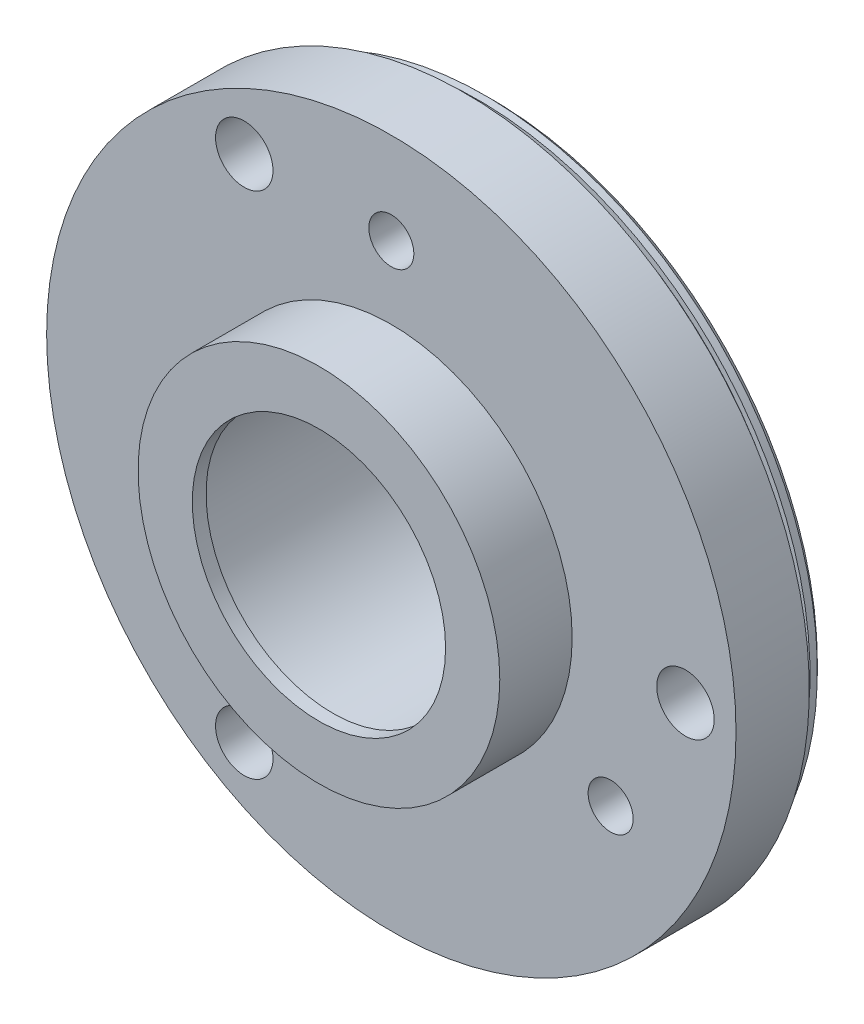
ISO-10303-21;
HEADER;
FILE_DESCRIPTION(('STEP AP214'),'2;1');
FILE_NAME('part.step','',(''),(''),'','','');
FILE_SCHEMA(('AUTOMOTIVE_DESIGN { 1 0 10303 214 1 1 1 1 }'));
ENDSEC;
DATA;
#1=APPLICATION_CONTEXT('core data for automotive mechanical design processes');
#2=APPLICATION_PROTOCOL_DEFINITION('international standard','automotive_design',2000,#1);
#3=PRODUCT_CONTEXT('',#1,'mechanical');
#4=PRODUCT('Part','Part','',(#3));
#5=PRODUCT_RELATED_PRODUCT_CATEGORY('part','',(#4));
#6=PRODUCT_DEFINITION_FORMATION('','',#4);
#7=PRODUCT_DEFINITION_CONTEXT('part definition',#1,'design');
#8=PRODUCT_DEFINITION('design','',#6,#7);
#9=PRODUCT_DEFINITION_SHAPE('','',#8);
#10=(LENGTH_UNIT() NAMED_UNIT(*) SI_UNIT(.MILLI.,.METRE.));
#11=(NAMED_UNIT(*) PLANE_ANGLE_UNIT() SI_UNIT($,.RADIAN.));
#12=(NAMED_UNIT(*) SI_UNIT($,.STERADIAN.) SOLID_ANGLE_UNIT());
#13=UNCERTAINTY_MEASURE_WITH_UNIT(LENGTH_MEASURE(1.E-05),#10,'distance_accuracy_value','');
#14=(GEOMETRIC_REPRESENTATION_CONTEXT(3) GLOBAL_UNCERTAINTY_ASSIGNED_CONTEXT((#13)) GLOBAL_UNIT_ASSIGNED_CONTEXT((#10,
#11,#12)) REPRESENTATION_CONTEXT('',''));
#15=CARTESIAN_POINT('',(0.,0.,0.));
#16=DIRECTION('',(0.,0.,1.));
#17=DIRECTION('',(1.,0.,0.));
#18=AXIS2_PLACEMENT_3D('',#15,#16,#17);
#19=CARTESIAN_POINT('',(0.,0.,0.));
#20=DIRECTION('',(0.,0.,1.));
#21=DIRECTION('',(1.,0.,0.));
#22=AXIS2_PLACEMENT_3D('',#19,#20,#21);
#23=PLANE('',#22);
#24=CARTESIAN_POINT('',(0.,0.,0.));
#25=DIRECTION('',(0.,0.,-1.));
#26=DIRECTION('',(-1.,0.,0.));
#27=AXIS2_PLACEMENT_3D('',#24,#25,#26);
#28=CIRCLE('',#27,12.3444);
#29=CARTESIAN_POINT('',(-12.3444,0.,0.));
#30=VERTEX_POINT('',#29);
#31=EDGE_CURVE('E95',#30,#30,#28,.T.);
#32=ORIENTED_EDGE('',*,*,#31,.T.);
#33=EDGE_LOOP('',(#32));
#34=FACE_BOUND('',#33,.T.);
#35=CARTESIAN_POINT('',(0.,0.,0.));
#36=DIRECTION('',(0.,0.,1.));
#37=DIRECTION('',(1.,0.,0.));
#38=AXIS2_PLACEMENT_3D('',#35,#36,#37);
#39=CIRCLE('',#38,8.255);
#40=CARTESIAN_POINT('',(8.255,0.,0.));
#41=VERTEX_POINT('',#40);
#42=EDGE_CURVE('E46',#41,#41,#39,.F.);
#43=ORIENTED_EDGE('',*,*,#42,.F.);
#44=EDGE_LOOP('',(#43));
#45=FACE_BOUND('',#44,.T.);
#46=ADVANCED_FACE('F35',(#34,#45),#23,.F.);
#47=CARTESIAN_POINT('',(0.,0.,10.5918));
#48=DIRECTION('',(0.,0.,-1.));
#49=DIRECTION('',(-1.,0.,0.));
#50=AXIS2_PLACEMENT_3D('',#47,#48,#49);
#51=CYLINDRICAL_SURFACE('',#50,19.05);
#52=CARTESIAN_POINT('',(0.,0.,6.5913));
#53=DIRECTION('',(0.,0.,1.));
#54=DIRECTION('',(1.,0.,0.));
#55=AXIS2_PLACEMENT_3D('',#52,#53,#54);
#56=CIRCLE('',#55,19.05);
#57=CARTESIAN_POINT('',(19.05,0.,6.5913));
#58=VERTEX_POINT('',#57);
#59=EDGE_CURVE('E63',#58,#58,#56,.T.);
#60=ORIENTED_EDGE('',*,*,#59,.F.);
#61=EDGE_LOOP('',(#60));
#62=FACE_BOUND('',#61,.T.);
#63=CARTESIAN_POINT('',(0.,0.,2.54));
#64=DIRECTION('',(0.,0.,-1.));
#65=DIRECTION('',(-1.,0.,0.));
#66=AXIS2_PLACEMENT_3D('',#63,#64,#65);
#67=CIRCLE('',#66,19.05);
#68=CARTESIAN_POINT('',(-19.05,0.,2.54));
#69=VERTEX_POINT('',#68);
#70=EDGE_CURVE('E67',#69,#69,#67,.T.);
#71=ORIENTED_EDGE('',*,*,#70,.F.);
#72=EDGE_LOOP('',(#71));
#73=FACE_BOUND('',#72,.T.);
#74=ADVANCED_FACE('F181',(#62,#73),#51,.T.);
#75=CARTESIAN_POINT('',(0.,0.,1.016));
#76=DIRECTION('',(0.,0.,-1.));
#77=DIRECTION('',(-1.,0.,0.));
#78=AXIS2_PLACEMENT_3D('',#75,#76,#77);
#79=PLANE('',#78);
#80=CARTESIAN_POINT('',(0.,0.,1.016));
#81=DIRECTION('',(0.,0.,-1.));
#82=DIRECTION('',(-1.,0.,0.));
#83=AXIS2_PLACEMENT_3D('',#80,#81,#82);
#84=CIRCLE('',#83,17.9705);
#85=CARTESIAN_POINT('',(-17.9705,0.,1.016));
#86=VERTEX_POINT('',#85);
#87=EDGE_CURVE('E60',#86,#86,#84,.T.);
#88=ORIENTED_EDGE('',*,*,#87,.T.);
#89=EDGE_LOOP('',(#88));
#90=FACE_BOUND('',#89,.T.);
#91=CARTESIAN_POINT('',(0.,0.,1.016));
#92=DIRECTION('',(0.,0.,-1.));
#93=DIRECTION('',(-1.,0.,0.));
#94=AXIS2_PLACEMENT_3D('',#91,#92,#93);
#95=CIRCLE('',#94,12.3444);
#96=CARTESIAN_POINT('',(-12.3444,0.,1.016));
#97=VERTEX_POINT('',#96);
#98=EDGE_CURVE('E102',#97,#97,#95,.T.);
#99=ORIENTED_EDGE('',*,*,#98,.F.);
#100=EDGE_LOOP('',(#99));
#101=FACE_BOUND('',#100,.T.);
#102=CARTESIAN_POINT('',(-8.12800000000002,14.0781089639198,1.016));
#103=DIRECTION('',(0.,0.,-1.));
#104=DIRECTION('',(-1.,0.,0.));
#105=AXIS2_PLACEMENT_3D('',#102,#103,#104);
#106=CIRCLE('',#105,1.0922);
#107=CARTESIAN_POINT('',(-9.22020000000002,14.0781089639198,1.016));
#108=VERTEX_POINT('',#107);
#109=EDGE_CURVE('E92',#108,#108,#106,.T.);
#110=ORIENTED_EDGE('',*,*,#109,.F.);
#111=EDGE_LOOP('',(#110));
#112=FACE_BOUND('',#111,.T.);
#113=CARTESIAN_POINT('',(-8.12799999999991,-14.0781089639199,1.016));
#114=DIRECTION('',(0.,0.,-1.));
#115=DIRECTION('',(-1.,0.,0.));
#116=AXIS2_PLACEMENT_3D('',#113,#114,#115);
#117=CIRCLE('',#116,1.0922);
#118=CARTESIAN_POINT('',(-9.22019999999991,-14.0781089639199,1.016));
#119=VERTEX_POINT('',#118);
#120=EDGE_CURVE('E89',#119,#119,#117,.T.);
#121=ORIENTED_EDGE('',*,*,#120,.F.);
#122=EDGE_LOOP('',(#121));
#123=FACE_BOUND('',#122,.T.);
#124=CARTESIAN_POINT('',(16.256,0.,1.016));
#125=DIRECTION('',(0.,0.,-1.));
#126=DIRECTION('',(-1.,0.,0.));
#127=AXIS2_PLACEMENT_3D('',#124,#125,#126);
#128=CIRCLE('',#127,1.0922);
#129=CARTESIAN_POINT('',(15.1638,0.,1.016));
#130=VERTEX_POINT('',#129);
#131=EDGE_CURVE('E85',#130,#130,#128,.T.);
#132=ORIENTED_EDGE('',*,*,#131,.F.);
#133=EDGE_LOOP('',(#132));
#134=FACE_BOUND('',#133,.T.);
#135=CARTESIAN_POINT('',(-10.5091948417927,13.9461725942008,1.016));
#136=DIRECTION('',(0.,0.,-1.));
#137=DIRECTION('',(-1.,0.,0.));
#138=AXIS2_PLACEMENT_3D('',#135,#136,#137);
#139=CIRCLE('',#138,0.393700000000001);
#140=CARTESIAN_POINT('',(-10.9028948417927,13.9461725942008,1.016));
#141=VERTEX_POINT('',#140);
#142=EDGE_CURVE('E71',#141,#141,#139,.T.);
#143=ORIENTED_EDGE('',*,*,#142,.F.);
#144=EDGE_LOOP('',(#143));
#145=FACE_BOUND('',#144,.T.);
#146=ADVANCED_FACE('F176',(#90,#101,#112,#123,#134,#145),#79,.T.);
#147=CARTESIAN_POINT('',(0.,0.,6.5913));
#148=DIRECTION('',(0.,0.,1.));
#149=DIRECTION('',(1.,0.,0.));
#150=AXIS2_PLACEMENT_3D('',#147,#148,#149);
#151=PLANE('',#150);
#152=CARTESIAN_POINT('',(-12.1203719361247,-6.99770000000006,6.5913));
#153=DIRECTION('',(0.,0.,1.));
#154=DIRECTION('',(1.,0.,0.));
#155=AXIS2_PLACEMENT_3D('',#152,#153,#154);
#156=CIRCLE('',#155,1.2446);
#157=CARTESIAN_POINT('',(-10.8757719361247,-6.99770000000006,6.5913));
#158=VERTEX_POINT('',#157);
#159=EDGE_CURVE('E145',#158,#158,#156,.T.);
#160=ORIENTED_EDGE('',*,*,#159,.F.);
#161=EDGE_LOOP('',(#160));
#162=FACE_BOUND('',#161,.T.);
#163=CARTESIAN_POINT('',(12.1203719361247,-6.99770000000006,6.5913));
#164=DIRECTION('',(0.,0.,1.));
#165=DIRECTION('',(1.,0.,0.));
#166=AXIS2_PLACEMENT_3D('',#163,#164,#165);
#167=CIRCLE('',#166,1.2446);
#168=CARTESIAN_POINT('',(13.3649719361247,-6.99770000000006,6.5913));
#169=VERTEX_POINT('',#168);
#170=EDGE_CURVE('E139',#169,#169,#167,.T.);
#171=ORIENTED_EDGE('',*,*,#170,.F.);
#172=EDGE_LOOP('',(#171));
#173=FACE_BOUND('',#172,.T.);
#174=CARTESIAN_POINT('',(0.,13.9954,6.5913));
#175=DIRECTION('',(0.,0.,1.));
#176=DIRECTION('',(1.,0.,0.));
#177=AXIS2_PLACEMENT_3D('',#174,#175,#176);
#178=CIRCLE('',#177,1.2446);
#179=CARTESIAN_POINT('',(1.2446,13.9954,6.5913));
#180=VERTEX_POINT('',#179);
#181=EDGE_CURVE('E133',#180,#180,#178,.T.);
#182=ORIENTED_EDGE('',*,*,#181,.F.);
#183=EDGE_LOOP('',(#182));
#184=FACE_BOUND('',#183,.T.);
#185=CARTESIAN_POINT('',(-8.12799999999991,-14.0781089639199,6.5913));
#186=DIRECTION('',(0.,0.,1.));
#187=DIRECTION('',(1.,0.,0.));
#188=AXIS2_PLACEMENT_3D('',#185,#186,#187);
#189=CIRCLE('',#188,1.5875);
#190=CARTESIAN_POINT('',(-6.54049999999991,-14.0781089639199,6.5913));
#191=VERTEX_POINT('',#190);
#192=EDGE_CURVE('E119',#191,#191,#189,.T.);
#193=ORIENTED_EDGE('',*,*,#192,.F.);
#194=EDGE_LOOP('',(#193));
#195=FACE_BOUND('',#194,.T.);
#196=CARTESIAN_POINT('',(16.256,0.,6.5913));
#197=DIRECTION('',(0.,0.,1.));
#198=DIRECTION('',(1.,0.,0.));
#199=AXIS2_PLACEMENT_3D('',#196,#197,#198);
#200=CIRCLE('',#199,1.5875);
#201=CARTESIAN_POINT('',(17.8435,0.,6.5913));
#202=VERTEX_POINT('',#201);
#203=EDGE_CURVE('E75',#202,#202,#200,.T.);
#204=ORIENTED_EDGE('',*,*,#203,.F.);
#205=EDGE_LOOP('',(#204));
#206=FACE_BOUND('',#205,.T.);
#207=CARTESIAN_POINT('',(-8.12800000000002,14.0781089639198,6.5913));
#208=DIRECTION('',(0.,0.,1.));
#209=DIRECTION('',(1.,0.,0.));
#210=AXIS2_PLACEMENT_3D('',#207,#208,#209);
#211=CIRCLE('',#210,1.5875);
#212=CARTESIAN_POINT('',(-6.54050000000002,14.0781089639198,6.5913));
#213=VERTEX_POINT('',#212);
#214=EDGE_CURVE('E80',#213,#213,#211,.T.);
#215=ORIENTED_EDGE('',*,*,#214,.F.);
#216=EDGE_LOOP('',(#215));
#217=FACE_BOUND('',#216,.T.);
#218=CARTESIAN_POINT('',(0.,0.,6.5913));
#219=DIRECTION('',(0.,0.,1.));
#220=DIRECTION('',(1.,0.,0.));
#221=AXIS2_PLACEMENT_3D('',#218,#219,#220);
#222=CIRCLE('',#221,9.9949);
#223=CARTESIAN_POINT('',(9.9949,0.,6.5913));
#224=VERTEX_POINT('',#223);
#225=EDGE_CURVE('E98',#224,#224,#222,.T.);
#226=ORIENTED_EDGE('',*,*,#225,.F.);
#227=EDGE_LOOP('',(#226));
#228=FACE_BOUND('',#227,.T.);
#229=ORIENTED_EDGE('',*,*,#59,.T.);
#230=EDGE_LOOP('',(#229));
#231=FACE_BOUND('',#230,.T.);
#232=ADVANCED_FACE('F170',(#162,#173,#184,#195,#206,#217,#228,#231),#151,.T.);
#233=CARTESIAN_POINT('',(0.,0.,6.5913));
#234=DIRECTION('',(0.,0.,1.));
#235=DIRECTION('',(1.,0.,0.));
#236=AXIS2_PLACEMENT_3D('',#233,#234,#235);
#237=CYLINDRICAL_SURFACE('',#236,9.9949);
#238=ORIENTED_EDGE('',*,*,#225,.T.);
#239=EDGE_LOOP('',(#238));
#240=FACE_BOUND('',#239,.T.);
#241=CARTESIAN_POINT('',(0.,0.,10.5918));
#242=DIRECTION('',(0.,0.,1.));
#243=DIRECTION('',(1.,0.,0.));
#244=AXIS2_PLACEMENT_3D('',#241,#242,#243);
#245=CIRCLE('',#244,9.9949);
#246=CARTESIAN_POINT('',(9.9949,0.,10.5918));
#247=VERTEX_POINT('',#246);
#248=EDGE_CURVE('E99',#247,#247,#245,.T.);
#249=ORIENTED_EDGE('',*,*,#248,.F.);
#250=EDGE_LOOP('',(#249));
#251=FACE_BOUND('',#250,.T.);
#252=ADVANCED_FACE('F165',(#240,#251),#237,.T.);
#253=CARTESIAN_POINT('',(0.,0.,10.5918));
#254=DIRECTION('',(0.,0.,1.));
#255=DIRECTION('',(1.,0.,0.));
#256=AXIS2_PLACEMENT_3D('',#253,#254,#255);
#257=PLANE('',#256);
#258=CARTESIAN_POINT('',(0.,0.,10.5918));
#259=DIRECTION('',(0.,0.,1.));
#260=DIRECTION('',(1.,0.,0.));
#261=AXIS2_PLACEMENT_3D('',#258,#259,#260);
#262=CIRCLE('',#261,6.999986);
#263=CARTESIAN_POINT('',(6.999986,0.,10.5918));
#264=VERTEX_POINT('',#263);
#265=EDGE_CURVE('E56',#264,#264,#262,.T.);
#266=ORIENTED_EDGE('',*,*,#265,.F.);
#267=EDGE_LOOP('',(#266));
#268=FACE_BOUND('',#267,.T.);
#269=ORIENTED_EDGE('',*,*,#248,.T.);
#270=EDGE_LOOP('',(#269));
#271=FACE_BOUND('',#270,.T.);
#272=ADVANCED_FACE('F161',(#268,#271),#257,.T.);
#273=CARTESIAN_POINT('',(0.,0.,1.016));
#274=DIRECTION('',(0.,0.,-1.));
#275=DIRECTION('',(-1.,0.,0.));
#276=AXIS2_PLACEMENT_3D('',#273,#274,#275);
#277=CYLINDRICAL_SURFACE('',#276,12.3444);
#278=ORIENTED_EDGE('',*,*,#98,.T.);
#279=EDGE_LOOP('',(#278));
#280=FACE_BOUND('',#279,.T.);
#281=ORIENTED_EDGE('',*,*,#31,.F.);
#282=EDGE_LOOP('',(#281));
#283=FACE_BOUND('',#282,.T.);
#284=ADVANCED_FACE('F164',(#280,#283),#277,.T.);
#285=CARTESIAN_POINT('',(-8.12800000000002,14.0781089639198,0.));
#286=DIRECTION('',(0.,0.,1.));
#287=DIRECTION('',(1.,0.,0.));
#288=AXIS2_PLACEMENT_3D('',#285,#286,#287);
#289=CYLINDRICAL_SURFACE('',#288,1.0922);
#290=CARTESIAN_POINT('',(-8.12800000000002,14.0781089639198,3.556));
#291=DIRECTION('',(0.,0.,-1.));
#292=DIRECTION('',(-1.,0.,0.));
#293=AXIS2_PLACEMENT_3D('',#290,#291,#292);
#294=CIRCLE('',#293,1.0922);
#295=CARTESIAN_POINT('',(-9.22020000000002,14.0781089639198,3.556));
#296=VERTEX_POINT('',#295);
#297=EDGE_CURVE('E82',#296,#296,#294,.F.);
#298=ORIENTED_EDGE('',*,*,#297,.T.);
#299=EDGE_LOOP('',(#298));
#300=FACE_BOUND('',#299,.T.);
#301=ORIENTED_EDGE('',*,*,#109,.T.);
#302=EDGE_LOOP('',(#301));
#303=FACE_BOUND('',#302,.T.);
#304=ADVANCED_FACE('F265',(#300,#303),#289,.F.);
#305=CARTESIAN_POINT('',(-8.12799999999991,-14.0781089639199,0.));
#306=DIRECTION('',(0.,0.,1.));
#307=DIRECTION('',(1.,0.,0.));
#308=AXIS2_PLACEMENT_3D('',#305,#306,#307);
#309=CYLINDRICAL_SURFACE('',#308,1.0922);
#310=CARTESIAN_POINT('',(-8.12799999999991,-14.0781089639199,3.556));
#311=DIRECTION('',(0.,0.,-1.));
#312=DIRECTION('',(-1.,0.,0.));
#313=AXIS2_PLACEMENT_3D('',#310,#311,#312);
#314=CIRCLE('',#313,1.0922);
#315=CARTESIAN_POINT('',(-9.22019999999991,-14.0781089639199,3.556));
#316=VERTEX_POINT('',#315);
#317=EDGE_CURVE('E72',#316,#316,#314,.F.);
#318=ORIENTED_EDGE('',*,*,#317,.T.);
#319=EDGE_LOOP('',(#318));
#320=FACE_BOUND('',#319,.T.);
#321=ORIENTED_EDGE('',*,*,#120,.T.);
#322=EDGE_LOOP('',(#321));
#323=FACE_BOUND('',#322,.T.);
#324=ADVANCED_FACE('F261',(#320,#323),#309,.F.);
#325=CARTESIAN_POINT('',(16.256,0.,0.));
#326=DIRECTION('',(0.,0.,1.));
#327=DIRECTION('',(1.,0.,0.));
#328=AXIS2_PLACEMENT_3D('',#325,#326,#327);
#329=CYLINDRICAL_SURFACE('',#328,1.0922);
#330=CARTESIAN_POINT('',(16.256,0.,3.556));
#331=DIRECTION('',(0.,0.,-1.));
#332=DIRECTION('',(-1.,0.,0.));
#333=AXIS2_PLACEMENT_3D('',#330,#331,#332);
#334=CIRCLE('',#333,1.0922);
#335=CARTESIAN_POINT('',(15.1638,0.,3.556));
#336=VERTEX_POINT('',#335);
#337=EDGE_CURVE('E77',#336,#336,#334,.F.);
#338=ORIENTED_EDGE('',*,*,#337,.T.);
#339=EDGE_LOOP('',(#338));
#340=FACE_BOUND('',#339,.T.);
#341=ORIENTED_EDGE('',*,*,#131,.T.);
#342=EDGE_LOOP('',(#341));
#343=FACE_BOUND('',#342,.T.);
#344=ADVANCED_FACE('F257',(#340,#343),#329,.F.);
#345=CARTESIAN_POINT('',(0.,0.,3.556));
#346=DIRECTION('',(0.,0.,-1.));
#347=DIRECTION('',(-1.,0.,0.));
#348=AXIS2_PLACEMENT_3D('',#345,#346,#347);
#349=PLANE('',#348);
#350=CARTESIAN_POINT('',(-8.12800000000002,14.0781089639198,3.556));
#351=DIRECTION('',(0.,0.,-1.));
#352=DIRECTION('',(-1.,0.,0.));
#353=AXIS2_PLACEMENT_3D('',#350,#351,#352);
#354=CIRCLE('',#353,1.5875);
#355=CARTESIAN_POINT('',(-6.54050000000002,14.0781089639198,3.556));
#356=VERTEX_POINT('',#355);
#357=EDGE_CURVE('E86',#356,#356,#354,.F.);
#358=ORIENTED_EDGE('',*,*,#357,.T.);
#359=EDGE_LOOP('',(#358));
#360=FACE_BOUND('',#359,.T.);
#361=ORIENTED_EDGE('',*,*,#297,.F.);
#362=EDGE_LOOP('',(#361));
#363=FACE_BOUND('',#362,.T.);
#364=ADVANCED_FACE('F253',(#360,#363),#349,.F.);
#365=CARTESIAN_POINT('',(-8.12800000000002,14.0781089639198,-3.47412806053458));
#366=DIRECTION('',(0.,0.,1.));
#367=DIRECTION('',(1.,0.,0.));
#368=AXIS2_PLACEMENT_3D('',#365,#366,#367);
#369=CYLINDRICAL_SURFACE('',#368,1.5875);
#370=CARTESIAN_POINT('',(-6.54050000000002,14.0781089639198,6.5913));
#371=CARTESIAN_POINT('',(-6.54050000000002,14.0781089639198,6.55968229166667));
#372=CARTESIAN_POINT('',(-6.54050000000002,14.0781089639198,6.52806458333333));
#373=CARTESIAN_POINT('',(-6.54050000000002,14.0781089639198,6.46482916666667));
#374=CARTESIAN_POINT('',(-6.54050000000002,14.0781089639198,6.43321145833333));
#375=CARTESIAN_POINT('',(-6.54050000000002,14.0781089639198,6.36997604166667));
#376=CARTESIAN_POINT('',(-6.54050000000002,14.0781089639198,6.33835833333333));
#377=CARTESIAN_POINT('',(-6.54050000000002,14.0781089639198,6.27512291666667));
#378=CARTESIAN_POINT('',(-6.54050000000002,14.0781089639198,6.24350520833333));
#379=CARTESIAN_POINT('',(-6.54050000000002,14.0781089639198,6.18026979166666));
#380=CARTESIAN_POINT('',(-6.54050000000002,14.0781089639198,6.14865208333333));
#381=CARTESIAN_POINT('',(-6.54050000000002,14.0781089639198,6.08541666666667));
#382=CARTESIAN_POINT('',(-6.54050000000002,14.0781089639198,6.05379895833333));
#383=CARTESIAN_POINT('',(-6.54050000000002,14.0781089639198,5.99056354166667));
#384=CARTESIAN_POINT('',(-6.54050000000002,14.0781089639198,5.95894583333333));
#385=CARTESIAN_POINT('',(-6.54050000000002,14.0781089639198,5.89571041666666));
#386=CARTESIAN_POINT('',(-6.54050000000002,14.0781089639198,5.86409270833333));
#387=CARTESIAN_POINT('',(-6.54050000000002,14.0781089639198,5.80085729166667));
#388=CARTESIAN_POINT('',(-6.54050000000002,14.0781089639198,5.76923958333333));
#389=CARTESIAN_POINT('',(-6.54050000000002,14.0781089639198,5.70600416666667));
#390=CARTESIAN_POINT('',(-6.54050000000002,14.0781089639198,5.67438645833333));
#391=CARTESIAN_POINT('',(-6.54050000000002,14.0781089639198,5.61115104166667));
#392=CARTESIAN_POINT('',(-6.54050000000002,14.0781089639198,5.57953333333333));
#393=CARTESIAN_POINT('',(-6.54050000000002,14.0781089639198,5.51629791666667));
#394=CARTESIAN_POINT('',(-6.54050000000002,14.0781089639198,5.48468020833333));
#395=CARTESIAN_POINT('',(-6.54050000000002,14.0781089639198,5.42144479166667));
#396=CARTESIAN_POINT('',(-6.54050000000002,14.0781089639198,5.38982708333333));
#397=CARTESIAN_POINT('',(-6.54050000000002,14.0781089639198,5.32659166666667));
#398=CARTESIAN_POINT('',(-6.54050000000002,14.0781089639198,5.29497395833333));
#399=CARTESIAN_POINT('',(-6.54050000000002,14.0781089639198,5.23173854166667));
#400=CARTESIAN_POINT('',(-6.54050000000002,14.0781089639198,5.20012083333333));
#401=CARTESIAN_POINT('',(-6.54050000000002,14.0781089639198,5.13688541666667));
#402=CARTESIAN_POINT('',(-6.54050000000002,14.0781089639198,5.10526770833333));
#403=CARTESIAN_POINT('',(-6.54050000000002,14.0781089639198,5.04203229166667));
#404=CARTESIAN_POINT('',(-6.54050000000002,14.0781089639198,5.01041458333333));
#405=CARTESIAN_POINT('',(-6.54050000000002,14.0781089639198,4.94717916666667));
#406=CARTESIAN_POINT('',(-6.54050000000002,14.0781089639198,4.91556145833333));
#407=CARTESIAN_POINT('',(-6.54050000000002,14.0781089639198,4.85232604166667));
#408=CARTESIAN_POINT('',(-6.54050000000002,14.0781089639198,4.82070833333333));
#409=CARTESIAN_POINT('',(-6.54050000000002,14.0781089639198,4.75747291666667));
#410=CARTESIAN_POINT('',(-6.54050000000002,14.0781089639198,4.72585520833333));
#411=CARTESIAN_POINT('',(-6.54050000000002,14.0781089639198,4.66261979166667));
#412=CARTESIAN_POINT('',(-6.54050000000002,14.0781089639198,4.63100208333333));
#413=CARTESIAN_POINT('',(-6.54050000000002,14.0781089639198,4.56776666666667));
#414=CARTESIAN_POINT('',(-6.54050000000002,14.0781089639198,4.53614895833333));
#415=CARTESIAN_POINT('',(-6.54050000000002,14.0781089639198,4.47291354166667));
#416=CARTESIAN_POINT('',(-6.54050000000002,14.0781089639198,4.44129583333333));
#417=CARTESIAN_POINT('',(-6.54050000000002,14.0781089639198,4.37806041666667));
#418=CARTESIAN_POINT('',(-6.54050000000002,14.0781089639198,4.34644270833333));
#419=CARTESIAN_POINT('',(-6.54050000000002,14.0781089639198,4.28320729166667));
#420=CARTESIAN_POINT('',(-6.54050000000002,14.0781089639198,4.25158958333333));
#421=CARTESIAN_POINT('',(-6.54050000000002,14.0781089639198,4.18835416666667));
#422=CARTESIAN_POINT('',(-6.54050000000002,14.0781089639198,4.15673645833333));
#423=CARTESIAN_POINT('',(-6.54050000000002,14.0781089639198,4.09350104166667));
#424=CARTESIAN_POINT('',(-6.54050000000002,14.0781089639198,4.06188333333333));
#425=CARTESIAN_POINT('',(-6.54050000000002,14.0781089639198,3.99864791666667));
#426=CARTESIAN_POINT('',(-6.54050000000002,14.0781089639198,3.96703020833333));
#427=CARTESIAN_POINT('',(-6.54050000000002,14.0781089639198,3.90379479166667));
#428=CARTESIAN_POINT('',(-6.54050000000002,14.0781089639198,3.87217708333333));
#429=CARTESIAN_POINT('',(-6.54050000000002,14.0781089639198,3.80894166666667));
#430=CARTESIAN_POINT('',(-6.54050000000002,14.0781089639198,3.77732395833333));
#431=CARTESIAN_POINT('',(-6.54050000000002,14.0781089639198,3.71408854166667));
#432=CARTESIAN_POINT('',(-6.54050000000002,14.0781089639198,3.68247083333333));
#433=CARTESIAN_POINT('',(-6.54050000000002,14.0781089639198,3.61923541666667));
#434=CARTESIAN_POINT('',(-6.54050000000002,14.0781089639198,3.58761770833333));
#435=CARTESIAN_POINT('',(-6.54050000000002,14.0781089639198,3.556));
#436=B_SPLINE_CURVE_WITH_KNOTS('',3,(#370,#371,#372,#373,#374,#375,#376,#377,#378,#379,#380,
#381,#382,#383,#384,#385,#386,#387,#388,#389,#390,#391,#392,#393,#394,#395,#396,#397,#398,#399,
#400,#401,#402,#403,#404,#405,#406,#407,#408,#409,#410,#411,#412,#413,#414,#415,#416,#417,#418,
#419,#420,#421,#422,#423,#424,#425,#426,#427,#428,#429,#430,#431,#432,#433,#434,#435),
.UNSPECIFIED.,.F.,.F.,(4,2,2,2,2,2,2,2,2,2,2,2,2,2,2,2,2,2,2,2,2,2,2,2,2,2,2,2,2,2,2,2,4),(0.,
0.0948531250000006,0.189706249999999,0.284559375,0.379412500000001,0.474265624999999,0.56911875,
0.663971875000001,0.758824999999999,0.853678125,0.948531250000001,1.043384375,1.1382375,
1.233090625,1.32794375,1.422796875,1.51765,1.612503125,1.70735625,1.802209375,1.8970625,
1.991915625,2.08676875,2.181621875,2.276475,2.371328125,2.46618125,2.561034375,2.6558875,
2.750740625,2.84559375,2.940446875,3.0353),.UNSPECIFIED.);
#437=EDGE_CURVE('BSEAM249',#213,#356,#436,.T.);
#438=ORIENTED_EDGE('',*,*,#214,.T.);
#439=ORIENTED_EDGE('',*,*,#357,.F.);
#440=ORIENTED_EDGE('',*,*,#437,.T.);
#441=ORIENTED_EDGE('',*,*,#437,.F.);
#442=EDGE_LOOP('',(#438,#440,#439,#441));
#443=FACE_BOUND('',#442,.T.);
#444=ADVANCED_FACE('F249',(#443),#369,.F.);
#445=CARTESIAN_POINT('',(0.,0.,3.556));
#446=DIRECTION('',(0.,0.,-1.));
#447=DIRECTION('',(-1.,0.,0.));
#448=AXIS2_PLACEMENT_3D('',#445,#446,#447);
#449=PLANE('',#448);
#450=CARTESIAN_POINT('',(16.256,0.,3.556));
#451=DIRECTION('',(0.,0.,-1.));
#452=DIRECTION('',(-1.,0.,0.));
#453=AXIS2_PLACEMENT_3D('',#450,#451,#452);
#454=CIRCLE('',#453,1.5875);
#455=CARTESIAN_POINT('',(17.8435,0.,3.556));
#456=VERTEX_POINT('',#455);
#457=EDGE_CURVE('E81',#456,#456,#454,.F.);
#458=ORIENTED_EDGE('',*,*,#457,.T.);
#459=EDGE_LOOP('',(#458));
#460=FACE_BOUND('',#459,.T.);
#461=ORIENTED_EDGE('',*,*,#337,.F.);
#462=EDGE_LOOP('',(#461));
#463=FACE_BOUND('',#462,.T.);
#464=ADVANCED_FACE('F245',(#460,#463),#449,.F.);
#465=CARTESIAN_POINT('',(16.256,0.,-3.47412806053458));
#466=DIRECTION('',(0.,0.,1.));
#467=DIRECTION('',(1.,0.,0.));
#468=AXIS2_PLACEMENT_3D('',#465,#466,#467);
#469=CYLINDRICAL_SURFACE('',#468,1.5875);
#470=CARTESIAN_POINT('',(17.8435,0.,6.5913));
#471=CARTESIAN_POINT('',(17.8435,0.,6.55968229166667));
#472=CARTESIAN_POINT('',(17.8435,0.,6.52806458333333));
#473=CARTESIAN_POINT('',(17.8435,0.,6.46482916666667));
#474=CARTESIAN_POINT('',(17.8435,0.,6.43321145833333));
#475=CARTESIAN_POINT('',(17.8435,0.,6.36997604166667));
#476=CARTESIAN_POINT('',(17.8435,0.,6.33835833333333));
#477=CARTESIAN_POINT('',(17.8435,0.,6.27512291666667));
#478=CARTESIAN_POINT('',(17.8435,0.,6.24350520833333));
#479=CARTESIAN_POINT('',(17.8435,0.,6.18026979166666));
#480=CARTESIAN_POINT('',(17.8435,0.,6.14865208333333));
#481=CARTESIAN_POINT('',(17.8435,0.,6.08541666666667));
#482=CARTESIAN_POINT('',(17.8435,0.,6.05379895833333));
#483=CARTESIAN_POINT('',(17.8435,0.,5.99056354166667));
#484=CARTESIAN_POINT('',(17.8435,0.,5.95894583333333));
#485=CARTESIAN_POINT('',(17.8435,0.,5.89571041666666));
#486=CARTESIAN_POINT('',(17.8435,0.,5.86409270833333));
#487=CARTESIAN_POINT('',(17.8435,0.,5.80085729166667));
#488=CARTESIAN_POINT('',(17.8435,0.,5.76923958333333));
#489=CARTESIAN_POINT('',(17.8435,0.,5.70600416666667));
#490=CARTESIAN_POINT('',(17.8435,0.,5.67438645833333));
#491=CARTESIAN_POINT('',(17.8435,0.,5.61115104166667));
#492=CARTESIAN_POINT('',(17.8435,0.,5.57953333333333));
#493=CARTESIAN_POINT('',(17.8435,0.,5.51629791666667));
#494=CARTESIAN_POINT('',(17.8435,0.,5.48468020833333));
#495=CARTESIAN_POINT('',(17.8435,0.,5.42144479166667));
#496=CARTESIAN_POINT('',(17.8435,0.,5.38982708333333));
#497=CARTESIAN_POINT('',(17.8435,0.,5.32659166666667));
#498=CARTESIAN_POINT('',(17.8435,0.,5.29497395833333));
#499=CARTESIAN_POINT('',(17.8435,0.,5.23173854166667));
#500=CARTESIAN_POINT('',(17.8435,0.,5.20012083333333));
#501=CARTESIAN_POINT('',(17.8435,0.,5.13688541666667));
#502=CARTESIAN_POINT('',(17.8435,0.,5.10526770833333));
#503=CARTESIAN_POINT('',(17.8435,0.,5.04203229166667));
#504=CARTESIAN_POINT('',(17.8435,0.,5.01041458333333));
#505=CARTESIAN_POINT('',(17.8435,0.,4.94717916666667));
#506=CARTESIAN_POINT('',(17.8435,0.,4.91556145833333));
#507=CARTESIAN_POINT('',(17.8435,0.,4.85232604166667));
#508=CARTESIAN_POINT('',(17.8435,0.,4.82070833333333));
#509=CARTESIAN_POINT('',(17.8435,0.,4.75747291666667));
#510=CARTESIAN_POINT('',(17.8435,0.,4.72585520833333));
#511=CARTESIAN_POINT('',(17.8435,0.,4.66261979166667));
#512=CARTESIAN_POINT('',(17.8435,0.,4.63100208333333));
#513=CARTESIAN_POINT('',(17.8435,0.,4.56776666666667));
#514=CARTESIAN_POINT('',(17.8435,0.,4.53614895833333));
#515=CARTESIAN_POINT('',(17.8435,0.,4.47291354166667));
#516=CARTESIAN_POINT('',(17.8435,0.,4.44129583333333));
#517=CARTESIAN_POINT('',(17.8435,0.,4.37806041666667));
#518=CARTESIAN_POINT('',(17.8435,0.,4.34644270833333));
#519=CARTESIAN_POINT('',(17.8435,0.,4.28320729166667));
#520=CARTESIAN_POINT('',(17.8435,0.,4.25158958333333));
#521=CARTESIAN_POINT('',(17.8435,0.,4.18835416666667));
#522=CARTESIAN_POINT('',(17.8435,0.,4.15673645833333));
#523=CARTESIAN_POINT('',(17.8435,0.,4.09350104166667));
#524=CARTESIAN_POINT('',(17.8435,0.,4.06188333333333));
#525=CARTESIAN_POINT('',(17.8435,0.,3.99864791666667));
#526=CARTESIAN_POINT('',(17.8435,0.,3.96703020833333));
#527=CARTESIAN_POINT('',(17.8435,0.,3.90379479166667));
#528=CARTESIAN_POINT('',(17.8435,0.,3.87217708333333));
#529=CARTESIAN_POINT('',(17.8435,0.,3.80894166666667));
#530=CARTESIAN_POINT('',(17.8435,0.,3.77732395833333));
#531=CARTESIAN_POINT('',(17.8435,0.,3.71408854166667));
#532=CARTESIAN_POINT('',(17.8435,0.,3.68247083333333));
#533=CARTESIAN_POINT('',(17.8435,0.,3.61923541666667));
#534=CARTESIAN_POINT('',(17.8435,0.,3.58761770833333));
#535=CARTESIAN_POINT('',(17.8435,0.,3.556));
#536=B_SPLINE_CURVE_WITH_KNOTS('',3,(#470,#471,#472,#473,#474,#475,#476,#477,#478,#479,#480,
#481,#482,#483,#484,#485,#486,#487,#488,#489,#490,#491,#492,#493,#494,#495,#496,#497,#498,#499,
#500,#501,#502,#503,#504,#505,#506,#507,#508,#509,#510,#511,#512,#513,#514,#515,#516,#517,#518,
#519,#520,#521,#522,#523,#524,#525,#526,#527,#528,#529,#530,#531,#532,#533,#534,#535),
.UNSPECIFIED.,.F.,.F.,(4,2,2,2,2,2,2,2,2,2,2,2,2,2,2,2,2,2,2,2,2,2,2,2,2,2,2,2,2,2,2,2,4),(0.,
0.0948531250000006,0.189706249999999,0.284559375,0.379412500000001,0.474265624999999,0.56911875,
0.663971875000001,0.758824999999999,0.853678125,0.948531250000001,1.043384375,1.1382375,
1.233090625,1.32794375,1.422796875,1.51765,1.612503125,1.70735625,1.802209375,1.8970625,
1.991915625,2.08676875,2.181621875,2.276475,2.371328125,2.46618125,2.561034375,2.6558875,
2.750740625,2.84559375,2.940446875,3.0353),.UNSPECIFIED.);
#537=EDGE_CURVE('BSEAM241',#202,#456,#536,.T.);
#538=ORIENTED_EDGE('',*,*,#203,.T.);
#539=ORIENTED_EDGE('',*,*,#457,.F.);
#540=ORIENTED_EDGE('',*,*,#537,.T.);
#541=ORIENTED_EDGE('',*,*,#537,.F.);
#542=EDGE_LOOP('',(#538,#540,#539,#541));
#543=FACE_BOUND('',#542,.T.);
#544=ADVANCED_FACE('F241',(#543),#469,.F.);
#545=CARTESIAN_POINT('',(0.,0.,3.556));
#546=DIRECTION('',(0.,0.,-1.));
#547=DIRECTION('',(-1.,0.,0.));
#548=AXIS2_PLACEMENT_3D('',#545,#546,#547);
#549=PLANE('',#548);
#550=CARTESIAN_POINT('',(-8.12799999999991,-14.0781089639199,3.556));
#551=DIRECTION('',(0.,0.,-1.));
#552=DIRECTION('',(-1.,0.,0.));
#553=AXIS2_PLACEMENT_3D('',#550,#551,#552);
#554=CIRCLE('',#553,1.5875);
#555=CARTESIAN_POINT('',(-6.54049999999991,-14.0781089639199,3.556));
#556=VERTEX_POINT('',#555);
#557=EDGE_CURVE('E76',#556,#556,#554,.F.);
#558=ORIENTED_EDGE('',*,*,#557,.T.);
#559=EDGE_LOOP('',(#558));
#560=FACE_BOUND('',#559,.T.);
#561=ORIENTED_EDGE('',*,*,#317,.F.);
#562=EDGE_LOOP('',(#561));
#563=FACE_BOUND('',#562,.T.);
#564=ADVANCED_FACE('F233',(#560,#563),#549,.F.);
#565=CARTESIAN_POINT('',(-8.12799999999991,-14.0781089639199,-3.47412806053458));
#566=DIRECTION('',(0.,0.,1.));
#567=DIRECTION('',(1.,0.,0.));
#568=AXIS2_PLACEMENT_3D('',#565,#566,#567);
#569=CYLINDRICAL_SURFACE('',#568,1.5875);
#570=CARTESIAN_POINT('',(-6.54049999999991,-14.0781089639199,6.5913));
#571=CARTESIAN_POINT('',(-6.54049999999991,-14.0781089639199,6.55968229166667));
#572=CARTESIAN_POINT('',(-6.54049999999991,-14.0781089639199,6.52806458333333));
#573=CARTESIAN_POINT('',(-6.54049999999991,-14.0781089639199,6.46482916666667));
#574=CARTESIAN_POINT('',(-6.54049999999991,-14.0781089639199,6.43321145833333));
#575=CARTESIAN_POINT('',(-6.54049999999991,-14.0781089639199,6.36997604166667));
#576=CARTESIAN_POINT('',(-6.54049999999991,-14.0781089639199,6.33835833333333));
#577=CARTESIAN_POINT('',(-6.54049999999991,-14.0781089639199,6.27512291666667));
#578=CARTESIAN_POINT('',(-6.54049999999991,-14.0781089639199,6.24350520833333));
#579=CARTESIAN_POINT('',(-6.54049999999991,-14.0781089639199,6.18026979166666));
#580=CARTESIAN_POINT('',(-6.54049999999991,-14.0781089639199,6.14865208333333));
#581=CARTESIAN_POINT('',(-6.54049999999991,-14.0781089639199,6.08541666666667));
#582=CARTESIAN_POINT('',(-6.54049999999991,-14.0781089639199,6.05379895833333));
#583=CARTESIAN_POINT('',(-6.54049999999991,-14.0781089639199,5.99056354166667));
#584=CARTESIAN_POINT('',(-6.54049999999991,-14.0781089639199,5.95894583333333));
#585=CARTESIAN_POINT('',(-6.54049999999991,-14.0781089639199,5.89571041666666));
#586=CARTESIAN_POINT('',(-6.54049999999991,-14.0781089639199,5.86409270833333));
#587=CARTESIAN_POINT('',(-6.54049999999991,-14.0781089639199,5.80085729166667));
#588=CARTESIAN_POINT('',(-6.54049999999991,-14.0781089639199,5.76923958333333));
#589=CARTESIAN_POINT('',(-6.54049999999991,-14.0781089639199,5.70600416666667));
#590=CARTESIAN_POINT('',(-6.54049999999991,-14.0781089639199,5.67438645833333));
#591=CARTESIAN_POINT('',(-6.54049999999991,-14.0781089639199,5.61115104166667));
#592=CARTESIAN_POINT('',(-6.54049999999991,-14.0781089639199,5.57953333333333));
#593=CARTESIAN_POINT('',(-6.54049999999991,-14.0781089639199,5.51629791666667));
#594=CARTESIAN_POINT('',(-6.54049999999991,-14.0781089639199,5.48468020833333));
#595=CARTESIAN_POINT('',(-6.54049999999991,-14.0781089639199,5.42144479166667));
#596=CARTESIAN_POINT('',(-6.54049999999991,-14.0781089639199,5.38982708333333));
#597=CARTESIAN_POINT('',(-6.54049999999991,-14.0781089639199,5.32659166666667));
#598=CARTESIAN_POINT('',(-6.54049999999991,-14.0781089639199,5.29497395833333));
#599=CARTESIAN_POINT('',(-6.54049999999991,-14.0781089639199,5.23173854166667));
#600=CARTESIAN_POINT('',(-6.54049999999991,-14.0781089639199,5.20012083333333));
#601=CARTESIAN_POINT('',(-6.54049999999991,-14.0781089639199,5.13688541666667));
#602=CARTESIAN_POINT('',(-6.54049999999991,-14.0781089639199,5.10526770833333));
#603=CARTESIAN_POINT('',(-6.54049999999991,-14.0781089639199,5.04203229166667));
#604=CARTESIAN_POINT('',(-6.54049999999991,-14.0781089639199,5.01041458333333));
#605=CARTESIAN_POINT('',(-6.54049999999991,-14.0781089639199,4.94717916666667));
#606=CARTESIAN_POINT('',(-6.54049999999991,-14.0781089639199,4.91556145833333));
#607=CARTESIAN_POINT('',(-6.54049999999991,-14.0781089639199,4.85232604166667));
#608=CARTESIAN_POINT('',(-6.54049999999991,-14.0781089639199,4.82070833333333));
#609=CARTESIAN_POINT('',(-6.54049999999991,-14.0781089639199,4.75747291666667));
#610=CARTESIAN_POINT('',(-6.54049999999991,-14.0781089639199,4.72585520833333));
#611=CARTESIAN_POINT('',(-6.54049999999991,-14.0781089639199,4.66261979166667));
#612=CARTESIAN_POINT('',(-6.54049999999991,-14.0781089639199,4.63100208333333));
#613=CARTESIAN_POINT('',(-6.54049999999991,-14.0781089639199,4.56776666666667));
#614=CARTESIAN_POINT('',(-6.54049999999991,-14.0781089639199,4.53614895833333));
#615=CARTESIAN_POINT('',(-6.54049999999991,-14.0781089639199,4.47291354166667));
#616=CARTESIAN_POINT('',(-6.54049999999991,-14.0781089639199,4.44129583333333));
#617=CARTESIAN_POINT('',(-6.54049999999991,-14.0781089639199,4.37806041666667));
#618=CARTESIAN_POINT('',(-6.54049999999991,-14.0781089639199,4.34644270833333));
#619=CARTESIAN_POINT('',(-6.54049999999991,-14.0781089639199,4.28320729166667));
#620=CARTESIAN_POINT('',(-6.54049999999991,-14.0781089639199,4.25158958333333));
#621=CARTESIAN_POINT('',(-6.54049999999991,-14.0781089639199,4.18835416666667));
#622=CARTESIAN_POINT('',(-6.54049999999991,-14.0781089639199,4.15673645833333));
#623=CARTESIAN_POINT('',(-6.54049999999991,-14.0781089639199,4.09350104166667));
#624=CARTESIAN_POINT('',(-6.54049999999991,-14.0781089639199,4.06188333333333));
#625=CARTESIAN_POINT('',(-6.54049999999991,-14.0781089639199,3.99864791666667));
#626=CARTESIAN_POINT('',(-6.54049999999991,-14.0781089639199,3.96703020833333));
#627=CARTESIAN_POINT('',(-6.54049999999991,-14.0781089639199,3.90379479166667));
#628=CARTESIAN_POINT('',(-6.54049999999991,-14.0781089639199,3.87217708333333));
#629=CARTESIAN_POINT('',(-6.54049999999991,-14.0781089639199,3.80894166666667));
#630=CARTESIAN_POINT('',(-6.54049999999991,-14.0781089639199,3.77732395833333));
#631=CARTESIAN_POINT('',(-6.54049999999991,-14.0781089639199,3.71408854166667));
#632=CARTESIAN_POINT('',(-6.54049999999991,-14.0781089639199,3.68247083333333));
#633=CARTESIAN_POINT('',(-6.54049999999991,-14.0781089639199,3.61923541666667));
#634=CARTESIAN_POINT('',(-6.54049999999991,-14.0781089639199,3.58761770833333));
#635=CARTESIAN_POINT('',(-6.54049999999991,-14.0781089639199,3.556));
#636=B_SPLINE_CURVE_WITH_KNOTS('',3,(#570,#571,#572,#573,#574,#575,#576,#577,#578,#579,#580,
#581,#582,#583,#584,#585,#586,#587,#588,#589,#590,#591,#592,#593,#594,#595,#596,#597,#598,#599,
#600,#601,#602,#603,#604,#605,#606,#607,#608,#609,#610,#611,#612,#613,#614,#615,#616,#617,#618,
#619,#620,#621,#622,#623,#624,#625,#626,#627,#628,#629,#630,#631,#632,#633,#634,#635),
.UNSPECIFIED.,.F.,.F.,(4,2,2,2,2,2,2,2,2,2,2,2,2,2,2,2,2,2,2,2,2,2,2,2,2,2,2,2,2,2,2,2,4),(0.,
0.0948531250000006,0.189706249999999,0.284559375,0.379412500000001,0.474265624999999,0.56911875,
0.663971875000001,0.758824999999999,0.853678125,0.948531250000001,1.043384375,1.1382375,
1.233090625,1.32794375,1.422796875,1.51765,1.612503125,1.70735625,1.802209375,1.8970625,
1.991915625,2.08676875,2.181621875,2.276475,2.371328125,2.46618125,2.561034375,2.6558875,
2.750740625,2.84559375,2.940446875,3.0353),.UNSPECIFIED.);
#637=EDGE_CURVE('BSEAM223',#191,#556,#636,.T.);
#638=ORIENTED_EDGE('',*,*,#192,.T.);
#639=ORIENTED_EDGE('',*,*,#557,.F.);
#640=ORIENTED_EDGE('',*,*,#637,.T.);
#641=ORIENTED_EDGE('',*,*,#637,.F.);
#642=EDGE_LOOP('',(#638,#640,#639,#641));
#643=FACE_BOUND('',#642,.T.);
#644=ADVANCED_FACE('F223',(#643),#569,.F.);
#645=CARTESIAN_POINT('',(-10.5091948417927,13.9461725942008,2.794));
#646=DIRECTION('',(0.,0.,-1.));
#647=DIRECTION('',(-1.,0.,0.));
#648=AXIS2_PLACEMENT_3D('',#645,#646,#647);
#649=CYLINDRICAL_SURFACE('',#648,0.393700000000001);
#650=CARTESIAN_POINT('',(-10.5091948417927,13.9461725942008,2.794));
#651=DIRECTION('',(0.,0.,-1.));
#652=DIRECTION('',(-1.,0.,0.));
#653=AXIS2_PLACEMENT_3D('',#650,#651,#652);
#654=CIRCLE('',#653,0.393700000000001);
#655=CARTESIAN_POINT('',(-10.9028948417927,13.9461725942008,2.794));
#656=VERTEX_POINT('',#655);
#657=EDGE_CURVE('E122',#656,#656,#654,.T.);
#658=ORIENTED_EDGE('',*,*,#657,.F.);
#659=EDGE_LOOP('',(#658));
#660=FACE_BOUND('',#659,.T.);
#661=ORIENTED_EDGE('',*,*,#142,.T.);
#662=EDGE_LOOP('',(#661));
#663=FACE_BOUND('',#662,.T.);
#664=ADVANCED_FACE('F220',(#660,#663),#649,.F.);
#665=CARTESIAN_POINT('',(-10.5091948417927,13.9461725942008,2.794));
#666=DIRECTION('',(0.,0.,-1.));
#667=DIRECTION('',(-1.,0.,0.));
#668=AXIS2_PLACEMENT_3D('',#665,#666,#667);
#669=PLANE('',#668);
#670=ORIENTED_EDGE('',*,*,#657,.T.);
#671=EDGE_LOOP('',(#670));
#672=FACE_BOUND('',#671,.T.);
#673=ADVANCED_FACE('F222',(#672),#669,.T.);
#674=CARTESIAN_POINT('',(0.,0.,2.54));
#675=DIRECTION('',(0.,0.,-1.));
#676=DIRECTION('',(-1.,0.,0.));
#677=AXIS2_PLACEMENT_3D('',#674,#675,#676);
#678=PLANE('',#677);
#679=ORIENTED_EDGE('',*,*,#70,.T.);
#680=EDGE_LOOP('',(#679));
#681=FACE_BOUND('',#680,.T.);
#682=CARTESIAN_POINT('',(0.,0.,2.54));
#683=DIRECTION('',(0.,0.,-1.));
#684=DIRECTION('',(-1.,0.,0.));
#685=AXIS2_PLACEMENT_3D('',#682,#683,#684);
#686=CIRCLE('',#685,18.034);
#687=CARTESIAN_POINT('',(-18.034,0.,2.54));
#688=VERTEX_POINT('',#687);
#689=EDGE_CURVE('E129',#688,#688,#686,.T.);
#690=ORIENTED_EDGE('',*,*,#689,.F.);
#691=EDGE_LOOP('',(#690));
#692=FACE_BOUND('',#691,.T.);
#693=ADVANCED_FACE('F230',(#681,#692),#678,.T.);
#694=CARTESIAN_POINT('',(0.,0.,2.54));
#695=DIRECTION('',(0.,0.,-1.));
#696=DIRECTION('',(-1.,0.,0.));
#697=AXIS2_PLACEMENT_3D('',#694,#695,#696);
#698=CYLINDRICAL_SURFACE('',#697,18.3515);
#699=CARTESIAN_POINT('',(0.,0.,1.397));
#700=DIRECTION('',(0.,0.,-1.));
#701=DIRECTION('',(-1.,0.,0.));
#702=AXIS2_PLACEMENT_3D('',#699,#700,#701);
#703=CIRCLE('',#702,18.3515);
#704=CARTESIAN_POINT('',(-18.3515,0.,1.397));
#705=VERTEX_POINT('',#704);
#706=EDGE_CURVE('E50',#705,#705,#703,.F.);
#707=CARTESIAN_POINT('',(0.,0.,1.8034));
#708=DIRECTION('',(0.,0.,-1.));
#709=DIRECTION('',(-1.,0.,0.));
#710=AXIS2_PLACEMENT_3D('',#707,#708,#709);
#711=CIRCLE('',#710,18.3515);
#712=CARTESIAN_POINT('',(-18.3515,0.,1.8034));
#713=VERTEX_POINT('',#712);
#714=EDGE_CURVE('E64',#713,#713,#711,.F.);
#715=CARTESIAN_POINT('',(-18.3515,0.,1.397));
#716=CARTESIAN_POINT('',(-18.3515,0.,1.40123333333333));
#717=CARTESIAN_POINT('',(-18.3515,0.,1.40546666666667));
#718=CARTESIAN_POINT('',(-18.3515,0.,1.41393333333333));
#719=CARTESIAN_POINT('',(-18.3515,0.,1.41816666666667));
#720=CARTESIAN_POINT('',(-18.3515,0.,1.42663333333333));
#721=CARTESIAN_POINT('',(-18.3515,0.,1.43086666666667));
#722=CARTESIAN_POINT('',(-18.3515,0.,1.43933333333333));
#723=CARTESIAN_POINT('',(-18.3515,0.,1.44356666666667));
#724=CARTESIAN_POINT('',(-18.3515,0.,1.45203333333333));
#725=CARTESIAN_POINT('',(-18.3515,0.,1.45626666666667));
#726=CARTESIAN_POINT('',(-18.3515,0.,1.46473333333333));
#727=CARTESIAN_POINT('',(-18.3515,0.,1.46896666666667));
#728=CARTESIAN_POINT('',(-18.3515,0.,1.47743333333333));
#729=CARTESIAN_POINT('',(-18.3515,0.,1.48166666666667));
#730=CARTESIAN_POINT('',(-18.3515,0.,1.49013333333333));
#731=CARTESIAN_POINT('',(-18.3515,0.,1.49436666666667));
#732=CARTESIAN_POINT('',(-18.3515,0.,1.50283333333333));
#733=CARTESIAN_POINT('',(-18.3515,0.,1.50706666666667));
#734=CARTESIAN_POINT('',(-18.3515,0.,1.51553333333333));
#735=CARTESIAN_POINT('',(-18.3515,0.,1.51976666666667));
#736=CARTESIAN_POINT('',(-18.3515,0.,1.52823333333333));
#737=CARTESIAN_POINT('',(-18.3515,0.,1.53246666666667));
#738=CARTESIAN_POINT('',(-18.3515,0.,1.54093333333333));
#739=CARTESIAN_POINT('',(-18.3515,0.,1.54516666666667));
#740=CARTESIAN_POINT('',(-18.3515,0.,1.55363333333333));
#741=CARTESIAN_POINT('',(-18.3515,0.,1.55786666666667));
#742=CARTESIAN_POINT('',(-18.3515,0.,1.56633333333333));
#743=CARTESIAN_POINT('',(-18.3515,0.,1.57056666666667));
#744=CARTESIAN_POINT('',(-18.3515,0.,1.57903333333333));
#745=CARTESIAN_POINT('',(-18.3515,0.,1.58326666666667));
#746=CARTESIAN_POINT('',(-18.3515,0.,1.59173333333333));
#747=CARTESIAN_POINT('',(-18.3515,0.,1.59596666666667));
#748=CARTESIAN_POINT('',(-18.3515,0.,1.60443333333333));
#749=CARTESIAN_POINT('',(-18.3515,0.,1.60866666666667));
#750=CARTESIAN_POINT('',(-18.3515,0.,1.61713333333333));
#751=CARTESIAN_POINT('',(-18.3515,0.,1.62136666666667));
#752=CARTESIAN_POINT('',(-18.3515,0.,1.62983333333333));
#753=CARTESIAN_POINT('',(-18.3515,0.,1.63406666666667));
#754=CARTESIAN_POINT('',(-18.3515,0.,1.64253333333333));
#755=CARTESIAN_POINT('',(-18.3515,0.,1.64676666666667));
#756=CARTESIAN_POINT('',(-18.3515,0.,1.65523333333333));
#757=CARTESIAN_POINT('',(-18.3515,0.,1.65946666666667));
#758=CARTESIAN_POINT('',(-18.3515,0.,1.66793333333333));
#759=CARTESIAN_POINT('',(-18.3515,0.,1.67216666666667));
#760=CARTESIAN_POINT('',(-18.3515,0.,1.68063333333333));
#761=CARTESIAN_POINT('',(-18.3515,0.,1.68486666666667));
#762=CARTESIAN_POINT('',(-18.3515,0.,1.69333333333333));
#763=CARTESIAN_POINT('',(-18.3515,0.,1.69756666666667));
#764=CARTESIAN_POINT('',(-18.3515,0.,1.70603333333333));
#765=CARTESIAN_POINT('',(-18.3515,0.,1.71026666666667));
#766=CARTESIAN_POINT('',(-18.3515,0.,1.71873333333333));
#767=CARTESIAN_POINT('',(-18.3515,0.,1.72296666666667));
#768=CARTESIAN_POINT('',(-18.3515,0.,1.73143333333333));
#769=CARTESIAN_POINT('',(-18.3515,0.,1.73566666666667));
#770=CARTESIAN_POINT('',(-18.3515,0.,1.74413333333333));
#771=CARTESIAN_POINT('',(-18.3515,0.,1.74836666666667));
#772=CARTESIAN_POINT('',(-18.3515,0.,1.75683333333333));
#773=CARTESIAN_POINT('',(-18.3515,0.,1.76106666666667));
#774=CARTESIAN_POINT('',(-18.3515,0.,1.76953333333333));
#775=CARTESIAN_POINT('',(-18.3515,0.,1.77376666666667));
#776=CARTESIAN_POINT('',(-18.3515,0.,1.78223333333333));
#777=CARTESIAN_POINT('',(-18.3515,0.,1.78646666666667));
#778=CARTESIAN_POINT('',(-18.3515,0.,1.79493333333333));
#779=CARTESIAN_POINT('',(-18.3515,0.,1.79916666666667));
#780=CARTESIAN_POINT('',(-18.3515,0.,1.8034));
#781=B_SPLINE_CURVE_WITH_KNOTS('',3,(#715,#716,#717,#718,#719,#720,#721,#722,#723,#724,#725,
#726,#727,#728,#729,#730,#731,#732,#733,#734,#735,#736,#737,#738,#739,#740,#741,#742,#743,#744,
#745,#746,#747,#748,#749,#750,#751,#752,#753,#754,#755,#756,#757,#758,#759,#760,#761,#762,#763,
#764,#765,#766,#767,#768,#769,#770,#771,#772,#773,#774,#775,#776,#777,#778,#779,#780),
.UNSPECIFIED.,.F.,.F.,(4,2,2,2,2,2,2,2,2,2,2,2,2,2,2,2,2,2,2,2,2,2,2,2,2,2,2,2,2,2,2,2,4),(0.,
0.0127,0.0254000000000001,0.0381000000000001,0.0508000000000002,0.0635000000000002,
0.0762000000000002,0.0889000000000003,0.1016,0.114300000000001,0.127000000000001,
0.139700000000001,0.152400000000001,0.165100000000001,0.177800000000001,0.190500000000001,
0.203200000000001,0.215900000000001,0.228600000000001,0.241300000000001,0.254000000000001,
0.266700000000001,0.279400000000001,0.292100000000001,0.304800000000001,0.317500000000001,
0.330200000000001,0.342900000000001,0.355600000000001,0.368300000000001,0.381000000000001,
0.393700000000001,0.406400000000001),.UNSPECIFIED.);
#782=EDGE_CURVE('BSEAM341',#705,#713,#781,.T.);
#783=ORIENTED_EDGE('',*,*,#706,.T.);
#784=ORIENTED_EDGE('',*,*,#714,.F.);
#785=ORIENTED_EDGE('',*,*,#782,.T.);
#786=ORIENTED_EDGE('',*,*,#782,.F.);
#787=EDGE_LOOP('',(#783,#785,#784,#786));
#788=FACE_BOUND('',#787,.T.);
#789=ADVANCED_FACE('F341',(#788),#698,.T.);
#790=CARTESIAN_POINT('',(0.,19.304,1.8034));
#791=DIRECTION('',(0.,0.,-1.));
#792=DIRECTION('',(-1.,0.,0.));
#793=AXIS2_PLACEMENT_3D('',#790,#791,#792);
#794=PLANE('',#793);
#795=ORIENTED_EDGE('',*,*,#714,.T.);
#796=EDGE_LOOP('',(#795));
#797=FACE_BOUND('',#796,.T.);
#798=CARTESIAN_POINT('',(0.,0.,1.8034));
#799=DIRECTION('',(0.,0.,-1.));
#800=DIRECTION('',(-1.,0.,0.));
#801=AXIS2_PLACEMENT_3D('',#798,#799,#800);
#802=CIRCLE('',#801,18.034);
#803=CARTESIAN_POINT('',(-18.034,0.,1.8034));
#804=VERTEX_POINT('',#803);
#805=EDGE_CURVE('E68',#804,#804,#802,.T.);
#806=ORIENTED_EDGE('',*,*,#805,.T.);
#807=EDGE_LOOP('',(#806));
#808=FACE_BOUND('',#807,.T.);
#809=ADVANCED_FACE('F349',(#797,#808),#794,.F.);
#810=CARTESIAN_POINT('',(0.,0.,0.));
#811=DIRECTION('',(0.,0.,-1.));
#812=DIRECTION('',(-1.,0.,0.));
#813=AXIS2_PLACEMENT_3D('',#810,#811,#812);
#814=CYLINDRICAL_SURFACE('',#813,18.034);
#815=ORIENTED_EDGE('',*,*,#805,.F.);
#816=EDGE_LOOP('',(#815));
#817=FACE_BOUND('',#816,.T.);
#818=ORIENTED_EDGE('',*,*,#689,.T.);
#819=EDGE_LOOP('',(#818));
#820=FACE_BOUND('',#819,.T.);
#821=ADVANCED_FACE('F353',(#817,#820),#814,.T.);
#822=CARTESIAN_POINT('',(0.,13.9954,2.0193));
#823=DIRECTION('',(0.,0.,1.));
#824=DIRECTION('',(1.,0.,0.));
#825=AXIS2_PLACEMENT_3D('',#822,#823,#824);
#826=CYLINDRICAL_SURFACE('',#825,1.2446);
#827=CARTESIAN_POINT('',(0.,13.9954,2.0193));
#828=DIRECTION('',(0.,0.,1.));
#829=DIRECTION('',(1.,0.,0.));
#830=AXIS2_PLACEMENT_3D('',#827,#828,#829);
#831=CIRCLE('',#830,1.2446);
#832=CARTESIAN_POINT('',(1.2446,13.9954,2.0193));
#833=VERTEX_POINT('',#832);
#834=EDGE_CURVE('E132',#833,#833,#831,.T.);
#835=ORIENTED_EDGE('',*,*,#834,.F.);
#836=EDGE_LOOP('',(#835));
#837=FACE_BOUND('',#836,.T.);
#838=ORIENTED_EDGE('',*,*,#181,.T.);
#839=EDGE_LOOP('',(#838));
#840=FACE_BOUND('',#839,.T.);
#841=ADVANCED_FACE('F363',(#837,#840),#826,.F.);
#842=CARTESIAN_POINT('',(0.,13.9954,2.0193));
#843=DIRECTION('',(0.,0.,1.));
#844=DIRECTION('',(1.,0.,0.));
#845=AXIS2_PLACEMENT_3D('',#842,#843,#844);
#846=PLANE('',#845);
#847=ORIENTED_EDGE('',*,*,#834,.T.);
#848=EDGE_LOOP('',(#847));
#849=FACE_BOUND('',#848,.T.);
#850=ADVANCED_FACE('F381',(#849),#846,.T.);
#851=CARTESIAN_POINT('',(12.1203719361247,-6.99770000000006,2.0193));
#852=DIRECTION('',(0.,0.,1.));
#853=DIRECTION('',(1.,0.,0.));
#854=AXIS2_PLACEMENT_3D('',#851,#852,#853);
#855=CYLINDRICAL_SURFACE('',#854,1.2446);
#856=CARTESIAN_POINT('',(12.1203719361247,-6.99770000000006,2.0193));
#857=DIRECTION('',(0.,0.,1.));
#858=DIRECTION('',(1.,0.,0.));
#859=AXIS2_PLACEMENT_3D('',#856,#857,#858);
#860=CIRCLE('',#859,1.2446);
#861=CARTESIAN_POINT('',(13.3649719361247,-6.99770000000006,2.0193));
#862=VERTEX_POINT('',#861);
#863=EDGE_CURVE('E136',#862,#862,#860,.T.);
#864=ORIENTED_EDGE('',*,*,#863,.F.);
#865=EDGE_LOOP('',(#864));
#866=FACE_BOUND('',#865,.T.);
#867=ORIENTED_EDGE('',*,*,#170,.T.);
#868=EDGE_LOOP('',(#867));
#869=FACE_BOUND('',#868,.T.);
#870=ADVANCED_FACE('F391',(#866,#869),#855,.F.);
#871=CARTESIAN_POINT('',(12.1203719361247,-6.99770000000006,2.0193));
#872=DIRECTION('',(0.,0.,1.));
#873=DIRECTION('',(1.,0.,0.));
#874=AXIS2_PLACEMENT_3D('',#871,#872,#873);
#875=PLANE('',#874);
#876=ORIENTED_EDGE('',*,*,#863,.T.);
#877=EDGE_LOOP('',(#876));
#878=FACE_BOUND('',#877,.T.);
#879=ADVANCED_FACE('F401',(#878),#875,.T.);
#880=CARTESIAN_POINT('',(-12.1203719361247,-6.99770000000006,2.0193));
#881=DIRECTION('',(0.,0.,1.));
#882=DIRECTION('',(1.,0.,0.));
#883=AXIS2_PLACEMENT_3D('',#880,#881,#882);
#884=CYLINDRICAL_SURFACE('',#883,1.2446);
#885=CARTESIAN_POINT('',(-12.1203719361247,-6.99770000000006,2.0193));
#886=DIRECTION('',(0.,0.,1.));
#887=DIRECTION('',(1.,0.,0.));
#888=AXIS2_PLACEMENT_3D('',#885,#886,#887);
#889=CIRCLE('',#888,1.2446);
#890=CARTESIAN_POINT('',(-10.8757719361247,-6.99770000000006,2.0193));
#891=VERTEX_POINT('',#890);
#892=EDGE_CURVE('E142',#891,#891,#889,.T.);
#893=ORIENTED_EDGE('',*,*,#892,.F.);
#894=EDGE_LOOP('',(#893));
#895=FACE_BOUND('',#894,.T.);
#896=ORIENTED_EDGE('',*,*,#159,.T.);
#897=EDGE_LOOP('',(#896));
#898=FACE_BOUND('',#897,.T.);
#899=ADVANCED_FACE('F201',(#895,#898),#884,.F.);
#900=CARTESIAN_POINT('',(-12.1203719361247,-6.99770000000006,2.0193));
#901=DIRECTION('',(0.,0.,1.));
#902=DIRECTION('',(1.,0.,0.));
#903=AXIS2_PLACEMENT_3D('',#900,#901,#902);
#904=PLANE('',#903);
#905=ORIENTED_EDGE('',*,*,#892,.T.);
#906=EDGE_LOOP('',(#905));
#907=FACE_BOUND('',#906,.T.);
#908=ADVANCED_FACE('F193',(#907),#904,.T.);
#909=CARTESIAN_POINT('',(0.,0.,1.016));
#910=DIRECTION('',(0.,0.,1.));
#911=DIRECTION('',(1.,0.,0.));
#912=AXIS2_PLACEMENT_3D('',#909,#910,#911);
#913=CONICAL_SURFACE('',#912,17.9705,0.785398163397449);
#914=ORIENTED_EDGE('',*,*,#706,.F.);
#915=EDGE_LOOP('',(#914));
#916=FACE_BOUND('',#915,.T.);
#917=ORIENTED_EDGE('',*,*,#87,.F.);
#918=EDGE_LOOP('',(#917));
#919=FACE_BOUND('',#918,.T.);
#920=ADVANCED_FACE('F190',(#916,#919),#913,.T.);
#921=CARTESIAN_POINT('',(0.,0.,-0.635));
#922=DIRECTION('',(0.,0.,1.));
#923=DIRECTION('',(1.,0.,0.));
#924=AXIS2_PLACEMENT_3D('',#921,#922,#923);
#925=CYLINDRICAL_SURFACE('',#924,8.255);
#926=CARTESIAN_POINT('',(0.,0.,-0.253999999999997));
#927=DIRECTION('',(0.,0.,-1.));
#928=DIRECTION('',(-1.,0.,0.));
#929=AXIS2_PLACEMENT_3D('',#926,#927,#928);
#930=CIRCLE('',#929,8.255);
#931=CARTESIAN_POINT('',(-8.255,0.,-0.253999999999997));
#932=VERTEX_POINT('',#931);
#933=EDGE_CURVE('E11',#932,#932,#930,.F.);
#934=ORIENTED_EDGE('',*,*,#933,.T.);
#935=EDGE_LOOP('',(#934));
#936=FACE_BOUND('',#935,.T.);
#937=ORIENTED_EDGE('',*,*,#42,.T.);
#938=EDGE_LOOP('',(#937));
#939=FACE_BOUND('',#938,.T.);
#940=ADVANCED_FACE('F192',(#936,#939),#925,.T.);
#941=CARTESIAN_POINT('',(0.,0.,-0.635));
#942=DIRECTION('',(0.,0.,-1.));
#943=DIRECTION('',(-1.,0.,0.));
#944=AXIS2_PLACEMENT_3D('',#941,#942,#943);
#945=PLANE('',#944);
#946=CARTESIAN_POINT('',(0.,0.,-0.635));
#947=DIRECTION('',(0.,0.,-1.));
#948=DIRECTION('',(-1.,0.,0.));
#949=AXIS2_PLACEMENT_3D('',#946,#947,#948);
#950=CIRCLE('',#949,8.07733678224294);
#951=CARTESIAN_POINT('',(-8.07733678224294,0.,-0.635));
#952=VERTEX_POINT('',#951);
#953=EDGE_CURVE('E42',#952,#952,#950,.T.);
#954=ORIENTED_EDGE('',*,*,#953,.T.);
#955=EDGE_LOOP('',(#954));
#956=FACE_BOUND('',#955,.T.);
#957=CARTESIAN_POINT('',(0.,0.,-0.635));
#958=DIRECTION('',(0.,0.,-1.));
#959=DIRECTION('',(-1.,0.,0.));
#960=AXIS2_PLACEMENT_3D('',#957,#958,#959);
#961=CIRCLE('',#960,7.94512);
#962=CARTESIAN_POINT('',(-7.94512,0.,-0.635));
#963=VERTEX_POINT('',#962);
#964=EDGE_CURVE('E55',#963,#963,#961,.T.);
#965=ORIENTED_EDGE('',*,*,#964,.F.);
#966=EDGE_LOOP('',(#965));
#967=FACE_BOUND('',#966,.T.);
#968=ADVANCED_FACE('F199',(#956,#967),#945,.T.);
#969=CARTESIAN_POINT('',(0.,0.,9.8298));
#970=DIRECTION('',(0.,0.,1.));
#971=DIRECTION('',(1.,0.,0.));
#972=AXIS2_PLACEMENT_3D('',#969,#970,#971);
#973=PLANE('',#972);
#974=CARTESIAN_POINT('',(0.,0.,9.8298));
#975=DIRECTION('',(0.,0.,1.));
#976=DIRECTION('',(1.,0.,0.));
#977=AXIS2_PLACEMENT_3D('',#974,#975,#976);
#978=CIRCLE('',#977,6.999986);
#979=CARTESIAN_POINT('',(6.999986,0.,9.8298));
#980=VERTEX_POINT('',#979);
#981=EDGE_CURVE('E53',#980,#980,#978,.T.);
#982=ORIENTED_EDGE('',*,*,#981,.T.);
#983=EDGE_LOOP('',(#982));
#984=FACE_BOUND('',#983,.T.);
#985=CARTESIAN_POINT('',(0.,0.,9.8298));
#986=DIRECTION('',(0.,0.,1.));
#987=DIRECTION('',(1.,0.,0.));
#988=AXIS2_PLACEMENT_3D('',#985,#986,#987);
#989=CIRCLE('',#988,7.94512);
#990=CARTESIAN_POINT('',(7.94512,0.,9.8298));
#991=VERTEX_POINT('',#990);
#992=EDGE_CURVE('E148',#991,#991,#989,.F.);
#993=ORIENTED_EDGE('',*,*,#992,.T.);
#994=EDGE_LOOP('',(#993));
#995=FACE_BOUND('',#994,.T.);
#996=ADVANCED_FACE('F458',(#984,#995),#973,.F.);
#997=CARTESIAN_POINT('',(0.,0.,33.0639929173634));
#998=DIRECTION('',(0.,0.,-1.));
#999=DIRECTION('',(-1.,0.,0.));
#1000=AXIS2_PLACEMENT_3D('',#997,#998,#999);
#1001=CYLINDRICAL_SURFACE('',#1000,7.94512);
#1002=ORIENTED_EDGE('',*,*,#964,.T.);
#1003=EDGE_LOOP('',(#1002));
#1004=FACE_BOUND('',#1003,.T.);
#1005=ORIENTED_EDGE('',*,*,#992,.F.);
#1006=EDGE_LOOP('',(#1005));
#1007=FACE_BOUND('',#1006,.T.);
#1008=ADVANCED_FACE('F454',(#1004,#1007),#1001,.F.);
#1009=CARTESIAN_POINT('',(0.,0.,-0.635));
#1010=DIRECTION('',(0.,0.,1.));
#1011=DIRECTION('',(1.,0.,0.));
#1012=AXIS2_PLACEMENT_3D('',#1009,#1010,#1011);
#1013=CYLINDRICAL_SURFACE('',#1012,6.999986);
#1014=ORIENTED_EDGE('',*,*,#265,.T.);
#1015=EDGE_LOOP('',(#1014));
#1016=FACE_BOUND('',#1015,.T.);
#1017=ORIENTED_EDGE('',*,*,#981,.F.);
#1018=EDGE_LOOP('',(#1017));
#1019=FACE_BOUND('',#1018,.T.);
#1020=ADVANCED_FACE('F158',(#1016,#1019),#1013,.F.);
#1021=CARTESIAN_POINT('',(0.,0.,-0.635));
#1022=DIRECTION('',(0.,0.,1.));
#1023=DIRECTION('',(1.,0.,0.));
#1024=AXIS2_PLACEMENT_3D('',#1021,#1022,#1023);
#1025=CONICAL_SURFACE('',#1024,8.07733678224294,0.436332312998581);
#1026=ORIENTED_EDGE('',*,*,#933,.F.);
#1027=EDGE_LOOP('',(#1026));
#1028=FACE_BOUND('',#1027,.T.);
#1029=ORIENTED_EDGE('',*,*,#953,.F.);
#1030=EDGE_LOOP('',(#1029));
#1031=FACE_BOUND('',#1030,.T.);
#1032=ADVANCED_FACE('F37',(#1028,#1031),#1025,.T.);
#1033=CLOSED_SHELL('',(#46,#74,#146,#232,#252,#272,#284,#304,#324,#344,#364,#444,#464,#544,#564,
#644,#664,#673,#693,#789,#809,#821,#841,#850,#870,#879,#899,#908,#920,#940,#968,#996,#1008,
#1020,#1032));
#1034=MANIFOLD_SOLID_BREP('B2',#1033);
#1035=ADVANCED_BREP_SHAPE_REPRESENTATION('',(#18,#1034),#14);
#1036=SHAPE_DEFINITION_REPRESENTATION(#9,#1035);
ENDSEC;
END-ISO-10303-21;
